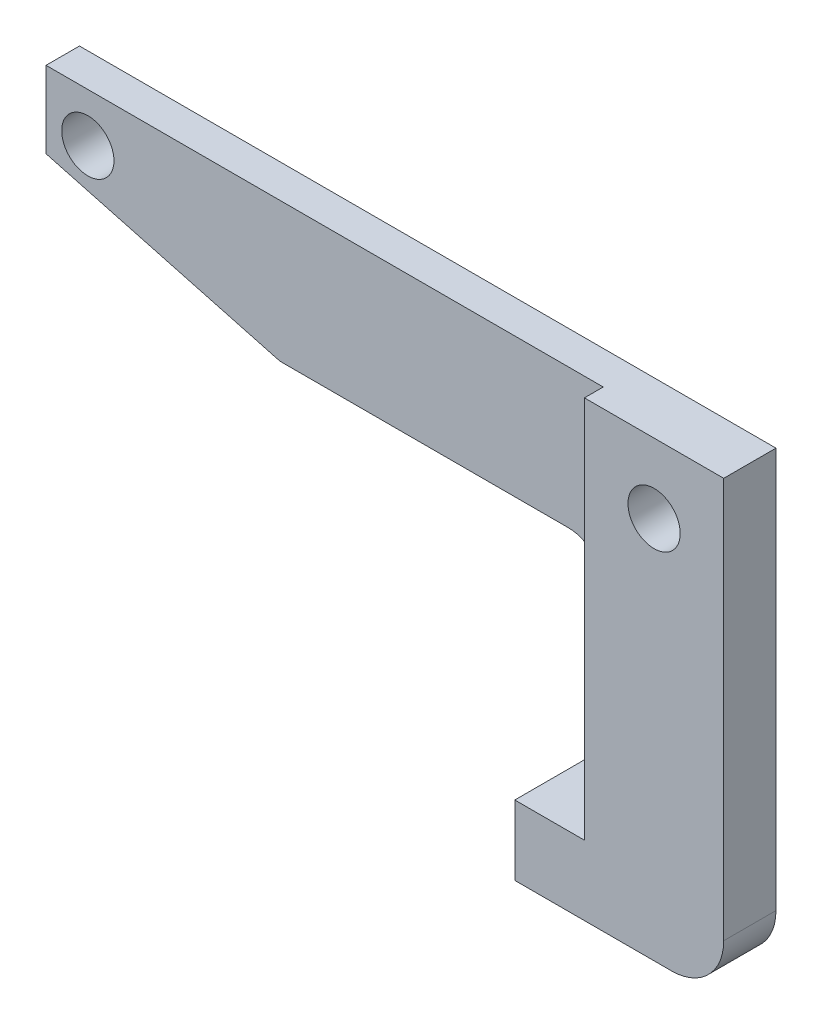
from build123d import *

# Parameters (mm, degrees)
BASE_EXTRUDE_DEPTH = 12.7
SKETCH2_R          = 4.7625
CUT_EXTRUDE1_DEPTH = 135.554087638
SKETCH3_R          = 4.7625
CUT_EXTRUDE2_DEPTH = 106.159296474
CHAMFER1_SIZE      = 11.43
CHAMFER1_SIZE2     = 42.657340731
SKETCH5_W          = 101.6
SKETCH5_H          = 25.4
CUT_EXTRUDE4_DEPTH = 3.429
FILLET2_R          = 9.525
CHAMFER2_SIZE      = 3.175
CHAMFER3_SIZE      = 3.175
FILLET3_R          = 6.35
SKETCH8_R          = 9.525
CUT_EXTRUDE5_DEPTH = 4.7752


with BuildPart() as part:
    # Sketch1 → Base-Extrude (new body)
    with BuildSketch(Plane.XY):
        Polygon((-114.3, 12.7), (-114.3, -12.7), (-12.7, -12.7), (-12.7, -57.15), (-25.4, -57.15), (-25.4, -69.85), (12.7, -69.85), (12.7, 12.7), align=None)
    extrude(amount=BASE_EXTRUDE_DEPTH)

    # Sketch2 → Cut-Extrude1 (cut, through all)
    with BuildSketch(Plane.XY.offset(12.7)):
        Circle(SKETCH2_R)
    extrude(amount=-CUT_EXTRUDE1_DEPTH, mode=Mode.SUBTRACT)

    # Sketch3 → Cut-Extrude2 (cut, through all)
    with BuildSketch(Plane(origin=(-40.826123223, 4.303739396, 12.7), x_dir=(1, 0, 0), z_dir=(0, 0, 1))):
        with Locations((-65.853876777, -0.493739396)):
            Circle(SKETCH3_R)
    extrude(amount=-CUT_EXTRUDE2_DEPTH, mode=Mode.SUBTRACT)

    # Chamfer1
    chamfer1_edges = [part.edges().sort_by_distance(p)[0] for p in [
        (-114.3, -12.7, 6.35),
    ]]
    chamfer1_side = [part.faces().sort_by_distance(p)[0] for p in [
        (-114.3, 0, 6.35),
    ]]
    chamfer(chamfer1_edges, length=CHAMFER1_SIZE, length2=CHAMFER1_SIZE2, reference=chamfer1_side[0])

    # Sketch5 → Cut-Extrude4 (cut)
    with BuildSketch(Plane(origin=(-65.557986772, -0.200650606, 12.7), x_dir=(1, 0, 0), z_dir=(0, 0, 1))):
        with Locations((2.057986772, 0.200650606)):
            Rectangle(SKETCH5_W, SKETCH5_H)
    extrude(amount=-CUT_EXTRUDE4_DEPTH, mode=Mode.SUBTRACT)

    # Fillet2
    fillet2_edges = [part.edges().sort_by_distance(p)[0] for p in [
        (12.7, -69.85, 6.35),
    ]]
    fillet(fillet2_edges, radius=FILLET2_R)

    # Chamfer2
    chamfer2_edges = [part.edges().sort_by_distance(p)[0] for p in [
        (-11.1125, -69.85, 0),
        (9.910192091, -67.060192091, 0),
        (12.7, -23.8125, 0),
    ]]
    chamfer(chamfer2_edges, length=CHAMFER2_SIZE)

    # Chamfer3
    chamfer3_edges = [part.edges().sort_by_distance(p)[0] for p in [
        (-52.3875, 12.7, 0),
    ]]
    chamfer(chamfer3_edges, length=CHAMFER3_SIZE)

    # Fillet3
    fillet3_edges = [part.edges().sort_by_distance(p)[0] for p in [
        (-12.7, -12.7, 4.6355),
    ]]
    fillet(fillet3_edges, radius=FILLET3_R)

    # Sketch8 → Cut-Extrude5 (cut)
    with BuildSketch(Plane(origin=(0, 0, 0), x_dir=(-1, 0, 0), z_dir=(0, 0, -1))):
        Circle(SKETCH8_R)
    extrude(amount=-CUT_EXTRUDE5_DEPTH, mode=Mode.SUBTRACT)


solid = part.part
